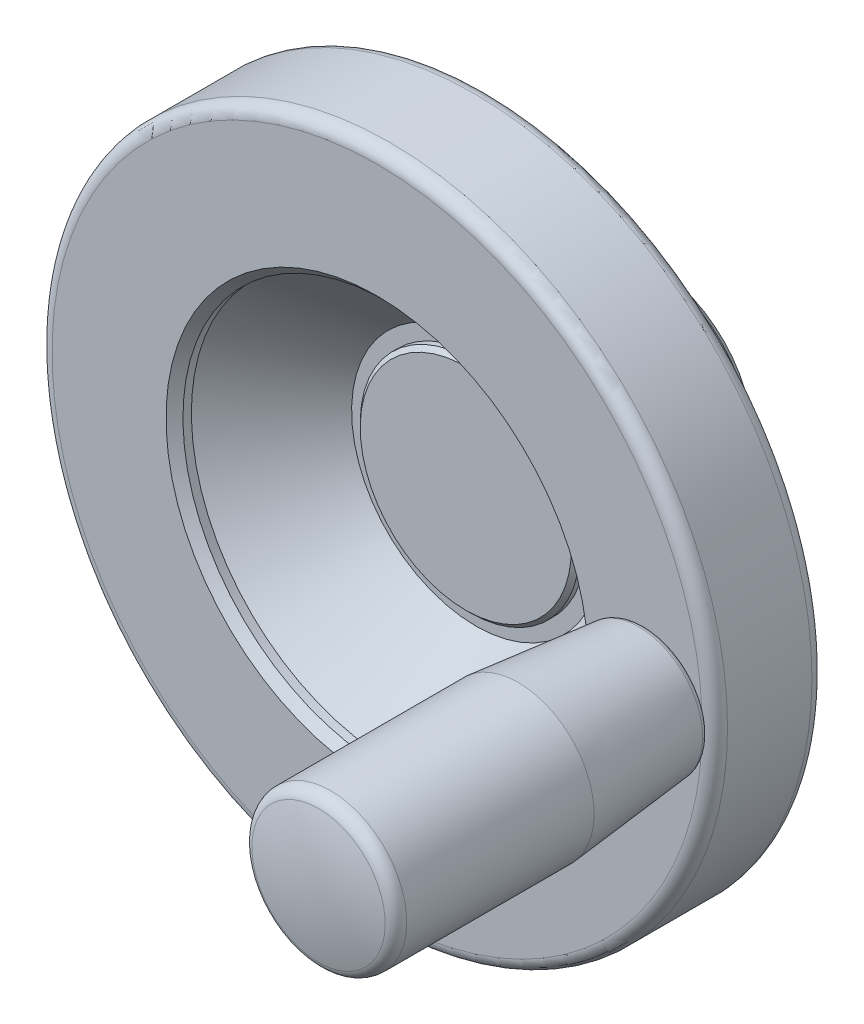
ISO-10303-21;
HEADER;
FILE_DESCRIPTION(('STEP AP214'),'2;1');
FILE_NAME('part.step','',(''),(''),'','','');
FILE_SCHEMA(('AUTOMOTIVE_DESIGN { 1 0 10303 214 1 1 1 1 }'));
ENDSEC;
DATA;
#1=APPLICATION_CONTEXT('core data for automotive mechanical design processes');
#2=APPLICATION_PROTOCOL_DEFINITION('international standard','automotive_design',2000,#1);
#3=PRODUCT_CONTEXT('',#1,'mechanical');
#4=PRODUCT('Part','Part','',(#3));
#5=PRODUCT_RELATED_PRODUCT_CATEGORY('part','',(#4));
#6=PRODUCT_DEFINITION_FORMATION('','',#4);
#7=PRODUCT_DEFINITION_CONTEXT('part definition',#1,'design');
#8=PRODUCT_DEFINITION('design','',#6,#7);
#9=PRODUCT_DEFINITION_SHAPE('','',#8);
#10=(LENGTH_UNIT() NAMED_UNIT(*) SI_UNIT(.MILLI.,.METRE.));
#11=(NAMED_UNIT(*) PLANE_ANGLE_UNIT() SI_UNIT($,.RADIAN.));
#12=(NAMED_UNIT(*) SI_UNIT($,.STERADIAN.) SOLID_ANGLE_UNIT());
#13=UNCERTAINTY_MEASURE_WITH_UNIT(LENGTH_MEASURE(1.E-05),#10,'distance_accuracy_value','');
#14=(GEOMETRIC_REPRESENTATION_CONTEXT(3) GLOBAL_UNCERTAINTY_ASSIGNED_CONTEXT((#13)) GLOBAL_UNIT_ASSIGNED_CONTEXT((#10,
#11,#12)) REPRESENTATION_CONTEXT('',''));
#15=CARTESIAN_POINT('',(0.,0.,0.));
#16=DIRECTION('',(0.,0.,1.));
#17=DIRECTION('',(1.,0.,0.));
#18=AXIS2_PLACEMENT_3D('',#15,#16,#17);
#19=CARTESIAN_POINT('',(38.5,0.,32.5));
#20=DIRECTION('',(0.,0.,-1.));
#21=DIRECTION('',(0.,1.,0.));
#22=AXIS2_PLACEMENT_3D('',#19,#20,#21);
#23=PLANE('',#22);
#24=CARTESIAN_POINT('',(0.,0.,32.5));
#25=DIRECTION('',(0.,0.,1.));
#26=DIRECTION('',(0.,-1.,0.));
#27=AXIS2_PLACEMENT_3D('',#24,#25,#26);
#28=CIRCLE('',#27,38.5);
#29=CARTESIAN_POINT('',(0.,-38.5,32.5));
#30=VERTEX_POINT('',#29);
#31=EDGE_CURVE('E73',#30,#30,#28,.T.);
#32=ORIENTED_EDGE('',*,*,#31,.T.);
#33=EDGE_LOOP('',(#32));
#34=FACE_BOUND('',#33,.T.);
#35=CARTESIAN_POINT('',(0.,0.,32.5));
#36=DIRECTION('',(0.,0.,1.));
#37=DIRECTION('',(0.,-1.,0.));
#38=AXIS2_PLACEMENT_3D('',#35,#36,#37);
#39=CIRCLE('',#38,25.);
#40=CARTESIAN_POINT('',(0.,-25.,32.5));
#41=VERTEX_POINT('',#40);
#42=EDGE_CURVE('E76',#41,#41,#39,.T.);
#43=ORIENTED_EDGE('',*,*,#42,.F.);
#44=EDGE_LOOP('',(#43));
#45=FACE_BOUND('',#44,.T.);
#46=CARTESIAN_POINT('',(32.,0.,32.5));
#47=DIRECTION('',(0.,0.,-1.));
#48=DIRECTION('',(0.,1.,0.));
#49=AXIS2_PLACEMENT_3D('',#46,#47,#48);
#50=CIRCLE('',#49,5.);
#51=CARTESIAN_POINT('',(32.,5.,32.5));
#52=VERTEX_POINT('',#51);
#53=EDGE_CURVE('E9',#52,#52,#50,.F.);
#54=ORIENTED_EDGE('',*,*,#53,.F.);
#55=EDGE_LOOP('',(#54));
#56=FACE_BOUND('',#55,.T.);
#57=ADVANCED_FACE('F14',(#34,#45,#56),#23,.F.);
#58=CARTESIAN_POINT('',(0.,0.,22.));
#59=DIRECTION('',(0.,0.,-1.));
#60=DIRECTION('',(0.,1.,0.));
#61=AXIS2_PLACEMENT_3D('',#58,#59,#60);
#62=CONICAL_SURFACE('',#61,12.5,0.785398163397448);
#63=CARTESIAN_POINT('',(0.,0.,21.5));
#64=DIRECTION('',(0.,0.,1.));
#65=DIRECTION('',(0.,-1.,0.));
#66=AXIS2_PLACEMENT_3D('',#63,#64,#65);
#67=CIRCLE('',#66,13.);
#68=CARTESIAN_POINT('',(0.,-13.,21.5));
#69=VERTEX_POINT('',#68);
#70=EDGE_CURVE('E91',#69,#69,#67,.T.);
#71=ORIENTED_EDGE('',*,*,#70,.T.);
#72=EDGE_LOOP('',(#71));
#73=FACE_BOUND('',#72,.T.);
#74=CARTESIAN_POINT('',(0.,0.,22.));
#75=DIRECTION('',(0.,0.,1.));
#76=DIRECTION('',(0.,-1.,0.));
#77=AXIS2_PLACEMENT_3D('',#74,#75,#76);
#78=CIRCLE('',#77,12.5);
#79=CARTESIAN_POINT('',(0.,-12.5,22.));
#80=VERTEX_POINT('',#79);
#81=EDGE_CURVE('E21',#80,#80,#78,.T.);
#82=ORIENTED_EDGE('',*,*,#81,.F.);
#83=EDGE_LOOP('',(#82));
#84=FACE_BOUND('',#83,.T.);
#85=ADVANCED_FACE('F16',(#73,#84),#62,.T.);
#86=CARTESIAN_POINT('',(0.,0.,22.));
#87=DIRECTION('',(0.,0.,1.));
#88=DIRECTION('',(0.,-1.,0.));
#89=AXIS2_PLACEMENT_3D('',#86,#87,#88);
#90=PLANE('',#89);
#91=ORIENTED_EDGE('',*,*,#81,.T.);
#92=EDGE_LOOP('',(#91));
#93=FACE_BOUND('',#92,.T.);
#94=ADVANCED_FACE('F28',(#93),#90,.T.);
#95=CARTESIAN_POINT('',(0.,0.,9.));
#96=DIRECTION('',(0.,0.,-1.));
#97=DIRECTION('',(0.,1.,0.));
#98=AXIS2_PLACEMENT_3D('',#95,#96,#97);
#99=CONICAL_SURFACE('',#98,2.99999999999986,1.04719755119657);
#100=CARTESIAN_POINT('',(0.,0.,10.732050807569));
#101=VERTEX_POINT('',#100);
#102=VERTEX_LOOP('',#101);
#103=FACE_BOUND('',#102,.T.);
#104=CARTESIAN_POINT('',(0.,0.,9.));
#105=DIRECTION('',(0.,0.,1.));
#106=DIRECTION('',(0.,-1.,0.));
#107=AXIS2_PLACEMENT_3D('',#104,#105,#106);
#108=CIRCLE('',#107,2.99999999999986);
#109=CARTESIAN_POINT('',(0.,-2.99999999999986,9.));
#110=VERTEX_POINT('',#109);
#111=EDGE_CURVE('E32',#110,#110,#108,.T.);
#112=ORIENTED_EDGE('',*,*,#111,.F.);
#113=EDGE_LOOP('',(#112));
#114=FACE_BOUND('',#113,.T.);
#115=ADVANCED_FACE('F24',(#103,#114),#99,.F.);
#116=CARTESIAN_POINT('',(0.,0.,31.5));
#117=DIRECTION('',(0.,0.,1.));
#118=DIRECTION('',(0.,-1.,0.));
#119=AXIS2_PLACEMENT_3D('',#116,#117,#118);
#120=CYLINDRICAL_SURFACE('',#119,2.99999999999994);
#121=ORIENTED_EDGE('',*,*,#111,.T.);
#122=EDGE_LOOP('',(#121));
#123=FACE_BOUND('',#122,.T.);
#124=CARTESIAN_POINT('',(0.,0.,0.));
#125=DIRECTION('',(0.,0.,1.));
#126=DIRECTION('',(0.,-1.,0.));
#127=AXIS2_PLACEMENT_3D('',#124,#125,#126);
#128=CIRCLE('',#127,3.);
#129=CARTESIAN_POINT('',(0.,-3.,0.));
#130=VERTEX_POINT('',#129);
#131=EDGE_CURVE('E34',#130,#130,#128,.T.);
#132=ORIENTED_EDGE('',*,*,#131,.F.);
#133=EDGE_LOOP('',(#132));
#134=FACE_BOUND('',#133,.T.);
#135=ADVANCED_FACE('F27',(#123,#134),#120,.F.);
#136=CARTESIAN_POINT('',(3.,0.,0.));
#137=DIRECTION('',(0.,0.,1.));
#138=DIRECTION('',(0.,-1.,0.));
#139=AXIS2_PLACEMENT_3D('',#136,#137,#138);
#140=PLANE('',#139);
#141=CARTESIAN_POINT('',(0.,0.,0.));
#142=DIRECTION('',(0.,0.,1.));
#143=DIRECTION('',(0.,-1.,0.));
#144=AXIS2_PLACEMENT_3D('',#141,#142,#143);
#145=CIRCLE('',#144,12.);
#146=CARTESIAN_POINT('',(0.,-12.,0.));
#147=VERTEX_POINT('',#146);
#148=EDGE_CURVE('E38',#147,#147,#145,.T.);
#149=ORIENTED_EDGE('',*,*,#148,.F.);
#150=EDGE_LOOP('',(#149));
#151=FACE_BOUND('',#150,.T.);
#152=ORIENTED_EDGE('',*,*,#131,.T.);
#153=EDGE_LOOP('',(#152));
#154=FACE_BOUND('',#153,.T.);
#155=ADVANCED_FACE('F182',(#151,#154),#140,.F.);
#156=CARTESIAN_POINT('',(0.,0.,0.));
#157=DIRECTION('',(0.,0.,1.));
#158=DIRECTION('',(0.,-1.,0.));
#159=AXIS2_PLACEMENT_3D('',#156,#157,#158);
#160=CONICAL_SURFACE('',#159,12.,0.785398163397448);
#161=CARTESIAN_POINT('',(0.,0.,1.));
#162=DIRECTION('',(0.,0.,1.));
#163=DIRECTION('',(0.,-1.,0.));
#164=AXIS2_PLACEMENT_3D('',#161,#162,#163);
#165=CIRCLE('',#164,13.);
#166=CARTESIAN_POINT('',(0.,-13.,1.));
#167=VERTEX_POINT('',#166);
#168=EDGE_CURVE('E43',#167,#167,#165,.T.);
#169=ORIENTED_EDGE('',*,*,#168,.F.);
#170=EDGE_LOOP('',(#169));
#171=FACE_BOUND('',#170,.T.);
#172=ORIENTED_EDGE('',*,*,#148,.T.);
#173=EDGE_LOOP('',(#172));
#174=FACE_BOUND('',#173,.T.);
#175=ADVANCED_FACE('F178',(#171,#174),#160,.T.);
#176=CARTESIAN_POINT('',(0.,0.,31.5));
#177=DIRECTION('',(0.,0.,1.));
#178=DIRECTION('',(0.,-1.,0.));
#179=AXIS2_PLACEMENT_3D('',#176,#177,#178);
#180=CYLINDRICAL_SURFACE('',#179,13.);
#181=ORIENTED_EDGE('',*,*,#168,.T.);
#182=EDGE_LOOP('',(#181));
#183=FACE_BOUND('',#182,.T.);
#184=CARTESIAN_POINT('',(0.,0.,11.6));
#185=DIRECTION('',(0.,0.,1.));
#186=DIRECTION('',(0.,-1.,0.));
#187=AXIS2_PLACEMENT_3D('',#184,#185,#186);
#188=CIRCLE('',#187,13.);
#189=CARTESIAN_POINT('',(0.,-13.,11.6));
#190=VERTEX_POINT('',#189);
#191=EDGE_CURVE('E46',#190,#190,#188,.T.);
#192=ORIENTED_EDGE('',*,*,#191,.F.);
#193=EDGE_LOOP('',(#192));
#194=FACE_BOUND('',#193,.T.);
#195=ADVANCED_FACE('F174',(#183,#194),#180,.T.);
#196=CARTESIAN_POINT('',(0.,0.,11.6));
#197=DIRECTION('',(0.,0.,1.));
#198=DIRECTION('',(0.,-1.,0.));
#199=AXIS2_PLACEMENT_3D('',#196,#197,#198);
#200=TOROIDAL_SURFACE('',#199,13.4,0.399999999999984);
#201=ORIENTED_EDGE('',*,*,#191,.T.);
#202=EDGE_LOOP('',(#201));
#203=FACE_BOUND('',#202,.T.);
#204=CARTESIAN_POINT('',(0.,0.,12.));
#205=DIRECTION('',(0.,0.,1.));
#206=DIRECTION('',(0.,-1.,0.));
#207=AXIS2_PLACEMENT_3D('',#204,#205,#206);
#208=CIRCLE('',#207,13.4);
#209=CARTESIAN_POINT('',(0.,-13.4,12.));
#210=VERTEX_POINT('',#209);
#211=EDGE_CURVE('E49',#210,#210,#208,.T.);
#212=ORIENTED_EDGE('',*,*,#211,.F.);
#213=EDGE_LOOP('',(#212));
#214=FACE_BOUND('',#213,.T.);
#215=ADVANCED_FACE('F170',(#203,#214),#200,.F.);
#216=CARTESIAN_POINT('',(15.,0.,12.));
#217=DIRECTION('',(0.,0.,-1.));
#218=DIRECTION('',(0.,1.,0.));
#219=AXIS2_PLACEMENT_3D('',#216,#217,#218);
#220=PLANE('',#219);
#221=ORIENTED_EDGE('',*,*,#211,.T.);
#222=EDGE_LOOP('',(#221));
#223=FACE_BOUND('',#222,.T.);
#224=CARTESIAN_POINT('',(0.,0.,12.));
#225=DIRECTION('',(0.,0.,1.));
#226=DIRECTION('',(0.,-1.,0.));
#227=AXIS2_PLACEMENT_3D('',#224,#225,#226);
#228=CIRCLE('',#227,15.);
#229=CARTESIAN_POINT('',(0.,-15.,12.));
#230=VERTEX_POINT('',#229);
#231=EDGE_CURVE('E52',#230,#230,#228,.T.);
#232=ORIENTED_EDGE('',*,*,#231,.F.);
#233=EDGE_LOOP('',(#232));
#234=FACE_BOUND('',#233,.T.);
#235=ADVANCED_FACE('F166',(#223,#234),#220,.T.);
#236=CARTESIAN_POINT('',(0.,0.,31.5));
#237=DIRECTION('',(0.,0.,1.));
#238=DIRECTION('',(0.,-1.,0.));
#239=AXIS2_PLACEMENT_3D('',#236,#237,#238);
#240=CYLINDRICAL_SURFACE('',#239,15.);
#241=CARTESIAN_POINT('',(0.,0.,12.675420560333));
#242=DIRECTION('',(0.,0.,1.));
#243=DIRECTION('',(0.,-1.,0.));
#244=AXIS2_PLACEMENT_3D('',#241,#242,#243);
#245=CIRCLE('',#244,15.);
#246=CARTESIAN_POINT('',(0.,-15.,12.675420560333));
#247=VERTEX_POINT('',#246);
#248=EDGE_CURVE('E55',#247,#247,#245,.T.);
#249=ORIENTED_EDGE('',*,*,#248,.F.);
#250=EDGE_LOOP('',(#249));
#251=FACE_BOUND('',#250,.T.);
#252=ORIENTED_EDGE('',*,*,#231,.T.);
#253=EDGE_LOOP('',(#252));
#254=FACE_BOUND('',#253,.T.);
#255=ADVANCED_FACE('F162',(#251,#254),#240,.T.);
#256=CARTESIAN_POINT('',(0.,0.,12.675420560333));
#257=DIRECTION('',(0.,0.,1.));
#258=DIRECTION('',(0.,-1.,0.));
#259=AXIS2_PLACEMENT_3D('',#256,#257,#258);
#260=TOROIDAL_SURFACE('',#259,20.,5.);
#261=ORIENTED_EDGE('',*,*,#248,.T.);
#262=EDGE_LOOP('',(#261));
#263=FACE_BOUND('',#262,.T.);
#264=CARTESIAN_POINT('',(0.,0.,15.833785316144));
#265=DIRECTION('',(0.,0.,1.));
#266=DIRECTION('',(0.,-1.,0.));
#267=AXIS2_PLACEMENT_3D('',#264,#265,#266);
#268=CIRCLE('',#267,16.1238250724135);
#269=CARTESIAN_POINT('',(0.,-16.1238250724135,15.833785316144));
#270=VERTEX_POINT('',#269);
#271=EDGE_CURVE('E58',#270,#270,#268,.T.);
#272=ORIENTED_EDGE('',*,*,#271,.F.);
#273=EDGE_LOOP('',(#272));
#274=FACE_BOUND('',#273,.T.);
#275=ADVANCED_FACE('F158',(#263,#274),#260,.F.);
#276=CARTESIAN_POINT('',(0.,0.,15.833785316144));
#277=DIRECTION('',(0.,0.,1.));
#278=DIRECTION('',(0.,-1.,0.));
#279=AXIS2_PLACEMENT_3D('',#276,#277,#278);
#280=CONICAL_SURFACE('',#279,16.1238250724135,0.683709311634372);
#281=CARTESIAN_POINT('',(0.,0.,19.5));
#282=DIRECTION('',(0.,0.,1.));
#283=DIRECTION('',(0.,-1.,0.));
#284=AXIS2_PLACEMENT_3D('',#281,#282,#283);
#285=CIRCLE('',#284,19.1111111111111);
#286=CARTESIAN_POINT('',(0.,-19.1111111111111,19.5));
#287=VERTEX_POINT('',#286);
#288=EDGE_CURVE('E61',#287,#287,#285,.T.);
#289=ORIENTED_EDGE('',*,*,#288,.F.);
#290=EDGE_LOOP('',(#289));
#291=FACE_BOUND('',#290,.T.);
#292=ORIENTED_EDGE('',*,*,#271,.T.);
#293=EDGE_LOOP('',(#292));
#294=FACE_BOUND('',#293,.T.);
#295=ADVANCED_FACE('F154',(#291,#294),#280,.T.);
#296=CARTESIAN_POINT('',(19.1111111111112,0.,19.5));
#297=DIRECTION('',(0.,0.,1.));
#298=DIRECTION('',(0.,-1.,0.));
#299=AXIS2_PLACEMENT_3D('',#296,#297,#298);
#300=PLANE('',#299);
#301=CARTESIAN_POINT('',(0.,0.,19.5));
#302=DIRECTION('',(0.,0.,1.));
#303=DIRECTION('',(0.,-1.,0.));
#304=AXIS2_PLACEMENT_3D('',#301,#302,#303);
#305=CIRCLE('',#304,38.5);
#306=CARTESIAN_POINT('',(0.,-38.5,19.5));
#307=VERTEX_POINT('',#306);
#308=EDGE_CURVE('E64',#307,#307,#305,.T.);
#309=ORIENTED_EDGE('',*,*,#308,.F.);
#310=EDGE_LOOP('',(#309));
#311=FACE_BOUND('',#310,.T.);
#312=ORIENTED_EDGE('',*,*,#288,.T.);
#313=EDGE_LOOP('',(#312));
#314=FACE_BOUND('',#313,.T.);
#315=ADVANCED_FACE('F150',(#311,#314),#300,.F.);
#316=CARTESIAN_POINT('',(0.,0.,21.));
#317=DIRECTION('',(0.,0.,1.));
#318=DIRECTION('',(0.,-1.,0.));
#319=AXIS2_PLACEMENT_3D('',#316,#317,#318);
#320=TOROIDAL_SURFACE('',#319,38.5,1.5);
#321=CARTESIAN_POINT('',(0.,0.,21.));
#322=DIRECTION('',(0.,0.,1.));
#323=DIRECTION('',(0.,-1.,0.));
#324=AXIS2_PLACEMENT_3D('',#321,#322,#323);
#325=CIRCLE('',#324,40.);
#326=CARTESIAN_POINT('',(0.,-40.,21.));
#327=VERTEX_POINT('',#326);
#328=EDGE_CURVE('E67',#327,#327,#325,.T.);
#329=ORIENTED_EDGE('',*,*,#328,.F.);
#330=EDGE_LOOP('',(#329));
#331=FACE_BOUND('',#330,.T.);
#332=ORIENTED_EDGE('',*,*,#308,.T.);
#333=EDGE_LOOP('',(#332));
#334=FACE_BOUND('',#333,.T.);
#335=ADVANCED_FACE('F146',(#331,#334),#320,.T.);
#336=CARTESIAN_POINT('',(0.,0.,31.5));
#337=DIRECTION('',(0.,0.,1.));
#338=DIRECTION('',(0.,-1.,0.));
#339=AXIS2_PLACEMENT_3D('',#336,#337,#338);
#340=CYLINDRICAL_SURFACE('',#339,40.);
#341=CARTESIAN_POINT('',(0.,0.,31.));
#342=DIRECTION('',(0.,0.,1.));
#343=DIRECTION('',(0.,-1.,0.));
#344=AXIS2_PLACEMENT_3D('',#341,#342,#343);
#345=CIRCLE('',#344,40.);
#346=CARTESIAN_POINT('',(0.,-40.,31.));
#347=VERTEX_POINT('',#346);
#348=EDGE_CURVE('E70',#347,#347,#345,.T.);
#349=ORIENTED_EDGE('',*,*,#348,.F.);
#350=EDGE_LOOP('',(#349));
#351=FACE_BOUND('',#350,.T.);
#352=ORIENTED_EDGE('',*,*,#328,.T.);
#353=EDGE_LOOP('',(#352));
#354=FACE_BOUND('',#353,.T.);
#355=ADVANCED_FACE('F142',(#351,#354),#340,.T.);
#356=CARTESIAN_POINT('',(0.,0.,31.));
#357=DIRECTION('',(0.,0.,1.));
#358=DIRECTION('',(0.,-1.,0.));
#359=AXIS2_PLACEMENT_3D('',#356,#357,#358);
#360=TOROIDAL_SURFACE('',#359,38.5,1.5);
#361=ORIENTED_EDGE('',*,*,#31,.F.);
#362=EDGE_LOOP('',(#361));
#363=FACE_BOUND('',#362,.T.);
#364=ORIENTED_EDGE('',*,*,#348,.T.);
#365=EDGE_LOOP('',(#364));
#366=FACE_BOUND('',#365,.T.);
#367=ADVANCED_FACE('F139',(#363,#366),#360,.T.);
#368=CARTESIAN_POINT('',(0.,0.,32.5));
#369=DIRECTION('',(0.,0.,1.));
#370=DIRECTION('',(0.,-1.,0.));
#371=AXIS2_PLACEMENT_3D('',#368,#369,#370);
#372=CONICAL_SURFACE('',#371,25.,0.785398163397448);
#373=CARTESIAN_POINT('',(0.,0.,31.5));
#374=DIRECTION('',(0.,0.,1.));
#375=DIRECTION('',(0.,-1.,0.));
#376=AXIS2_PLACEMENT_3D('',#373,#374,#375);
#377=CIRCLE('',#376,24.);
#378=CARTESIAN_POINT('',(0.,-24.,31.5));
#379=VERTEX_POINT('',#378);
#380=EDGE_CURVE('E79',#379,#379,#377,.T.);
#381=ORIENTED_EDGE('',*,*,#380,.F.);
#382=EDGE_LOOP('',(#381));
#383=FACE_BOUND('',#382,.T.);
#384=ORIENTED_EDGE('',*,*,#42,.T.);
#385=EDGE_LOOP('',(#384));
#386=FACE_BOUND('',#385,.T.);
#387=ADVANCED_FACE('F137',(#383,#386),#372,.F.);
#388=CARTESIAN_POINT('',(0.,0.,31.5));
#389=DIRECTION('',(0.,0.,1.));
#390=DIRECTION('',(0.,-1.,0.));
#391=AXIS2_PLACEMENT_3D('',#388,#389,#390);
#392=CYLINDRICAL_SURFACE('',#391,24.);
#393=CARTESIAN_POINT('',(0.,0.,30.5));
#394=DIRECTION('',(0.,0.,1.));
#395=DIRECTION('',(0.,-1.,0.));
#396=AXIS2_PLACEMENT_3D('',#393,#394,#395);
#397=CIRCLE('',#396,24.);
#398=CARTESIAN_POINT('',(0.,-24.,30.5));
#399=VERTEX_POINT('',#398);
#400=EDGE_CURVE('E82',#399,#399,#397,.T.);
#401=ORIENTED_EDGE('',*,*,#400,.F.);
#402=EDGE_LOOP('',(#401));
#403=FACE_BOUND('',#402,.T.);
#404=ORIENTED_EDGE('',*,*,#380,.T.);
#405=EDGE_LOOP('',(#404));
#406=FACE_BOUND('',#405,.T.);
#407=ADVANCED_FACE('F278',(#403,#406),#392,.F.);
#408=CARTESIAN_POINT('',(0.,0.,30.5));
#409=DIRECTION('',(0.,0.,1.));
#410=DIRECTION('',(0.,-1.,0.));
#411=AXIS2_PLACEMENT_3D('',#408,#409,#410);
#412=CONICAL_SURFACE('',#411,24.,0.763179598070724);
#413=CARTESIAN_POINT('',(0.,0.,20.8009437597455));
#414=DIRECTION('',(0.,0.,1.));
#415=DIRECTION('',(0.,-1.,0.));
#416=AXIS2_PLACEMENT_3D('',#413,#414,#415);
#417=CIRCLE('',#416,14.7226418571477);
#418=CARTESIAN_POINT('',(0.,-14.7226418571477,20.8009437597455));
#419=VERTEX_POINT('',#418);
#420=EDGE_CURVE('E85',#419,#419,#417,.T.);
#421=ORIENTED_EDGE('',*,*,#420,.F.);
#422=EDGE_LOOP('',(#421));
#423=FACE_BOUND('',#422,.T.);
#424=ORIENTED_EDGE('',*,*,#400,.T.);
#425=EDGE_LOOP('',(#424));
#426=FACE_BOUND('',#425,.T.);
#427=ADVANCED_FACE('F286',(#423,#426),#412,.F.);
#428=CARTESIAN_POINT('',(14.7226418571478,0.,20.8009437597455));
#429=DIRECTION('',(0.,0.,-1.));
#430=DIRECTION('',(0.,1.,0.));
#431=AXIS2_PLACEMENT_3D('',#428,#429,#430);
#432=PLANE('',#431);
#433=CARTESIAN_POINT('',(0.,0.,20.8009437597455));
#434=DIRECTION('',(0.,0.,1.));
#435=DIRECTION('',(0.,-1.,0.));
#436=AXIS2_PLACEMENT_3D('',#433,#434,#435);
#437=CIRCLE('',#436,13.);
#438=CARTESIAN_POINT('',(0.,-13.,20.8009437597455));
#439=VERTEX_POINT('',#438);
#440=EDGE_CURVE('E88',#439,#439,#437,.T.);
#441=ORIENTED_EDGE('',*,*,#440,.F.);
#442=EDGE_LOOP('',(#441));
#443=FACE_BOUND('',#442,.T.);
#444=ORIENTED_EDGE('',*,*,#420,.T.);
#445=EDGE_LOOP('',(#444));
#446=FACE_BOUND('',#445,.T.);
#447=ADVANCED_FACE('F294',(#443,#446),#432,.F.);
#448=CARTESIAN_POINT('',(0.,0.,31.5));
#449=DIRECTION('',(0.,0.,1.));
#450=DIRECTION('',(0.,-1.,0.));
#451=AXIS2_PLACEMENT_3D('',#448,#449,#450);
#452=CYLINDRICAL_SURFACE('',#451,13.);
#453=ORIENTED_EDGE('',*,*,#440,.T.);
#454=EDGE_LOOP('',(#453));
#455=FACE_BOUND('',#454,.T.);
#456=ORIENTED_EDGE('',*,*,#70,.F.);
#457=EDGE_LOOP('',(#456));
#458=FACE_BOUND('',#457,.T.);
#459=ADVANCED_FACE('F303',(#455,#458),#452,.T.);
#460=CARTESIAN_POINT('',(32.,0.,9.47604815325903));
#461=DIRECTION('',(0.,0.,-1.));
#462=DIRECTION('',(0.,1.,0.));
#463=AXIS2_PLACEMENT_3D('',#460,#461,#462);
#464=CYLINDRICAL_SURFACE('',#463,5.);
#465=ORIENTED_EDGE('',*,*,#53,.T.);
#466=EDGE_LOOP('',(#465));
#467=FACE_BOUND('',#466,.T.);
#468=CARTESIAN_POINT('',(32.,0.,32.8000000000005));
#469=DIRECTION('',(0.,0.,-1.));
#470=DIRECTION('',(0.,1.,0.));
#471=AXIS2_PLACEMENT_3D('',#468,#469,#470);
#472=CIRCLE('',#471,5.);
#473=CARTESIAN_POINT('',(32.,5.,32.8000000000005));
#474=VERTEX_POINT('',#473);
#475=EDGE_CURVE('E94',#474,#474,#472,.T.);
#476=ORIENTED_EDGE('',*,*,#475,.T.);
#477=EDGE_LOOP('',(#476));
#478=FACE_BOUND('',#477,.T.);
#479=ADVANCED_FACE('F312',(#467,#478),#464,.T.);
#480=CARTESIAN_POINT('',(38.77600995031,0.,32.8000000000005));
#481=DIRECTION('',(0.,0.,1.));
#482=DIRECTION('',(0.,-1.,0.));
#483=AXIS2_PLACEMENT_3D('',#480,#481,#482);
#484=PLANE('',#483);
#485=ORIENTED_EDGE('',*,*,#475,.F.);
#486=EDGE_LOOP('',(#485));
#487=FACE_BOUND('',#486,.T.);
#488=CARTESIAN_POINT('',(32.,0.,32.8000000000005));
#489=DIRECTION('',(0.,0.,-1.));
#490=DIRECTION('',(0.,1.,0.));
#491=AXIS2_PLACEMENT_3D('',#488,#489,#490);
#492=CIRCLE('',#491,6.77600995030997);
#493=CARTESIAN_POINT('',(32.,6.77600995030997,32.8000000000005));
#494=VERTEX_POINT('',#493);
#495=EDGE_CURVE('E97',#494,#494,#492,.T.);
#496=ORIENTED_EDGE('',*,*,#495,.T.);
#497=EDGE_LOOP('',(#496));
#498=FACE_BOUND('',#497,.T.);
#499=ADVANCED_FACE('F321',(#487,#498),#484,.F.);
#500=CARTESIAN_POINT('',(32.,0.,33.6000000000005));
#501=DIRECTION('',(0.,0.,-1.));
#502=DIRECTION('',(0.,1.,0.));
#503=AXIS2_PLACEMENT_3D('',#500,#501,#502);
#504=TOROIDAL_SURFACE('',#503,6.77600995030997,0.800000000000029);
#505=CARTESIAN_POINT('',(32.,0.,33.5203970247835));
#506=DIRECTION('',(0.,0.,-1.));
#507=DIRECTION('',(0.,1.,0.));
#508=AXIS2_PLACEMENT_3D('',#505,#506,#507);
#509=CIRCLE('',#508,7.572039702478);
#510=CARTESIAN_POINT('',(32.,7.572039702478,33.5203970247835));
#511=VERTEX_POINT('',#510);
#512=EDGE_CURVE('E100',#511,#511,#509,.T.);
#513=ORIENTED_EDGE('',*,*,#512,.T.);
#514=EDGE_LOOP('',(#513));
#515=FACE_BOUND('',#514,.T.);
#516=ORIENTED_EDGE('',*,*,#495,.F.);
#517=EDGE_LOOP('',(#516));
#518=FACE_BOUND('',#517,.T.);
#519=ADVANCED_FACE('F330',(#515,#518),#504,.T.);
#520=CARTESIAN_POINT('',(32.,0.,47.8));
#521=DIRECTION('',(0.,0.,1.));
#522=DIRECTION('',(0.,-1.,0.));
#523=AXIS2_PLACEMENT_3D('',#520,#521,#522);
#524=CONICAL_SURFACE('',#523,9.,0.0996686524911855);
#525=ORIENTED_EDGE('',*,*,#512,.F.);
#526=EDGE_LOOP('',(#525));
#527=FACE_BOUND('',#526,.T.);
#528=CARTESIAN_POINT('',(32.,0.,47.8));
#529=DIRECTION('',(0.,0.,-1.));
#530=DIRECTION('',(0.,1.,0.));
#531=AXIS2_PLACEMENT_3D('',#528,#529,#530);
#532=CIRCLE('',#531,9.);
#533=CARTESIAN_POINT('',(32.,9.,47.8));
#534=VERTEX_POINT('',#533);
#535=EDGE_CURVE('E103',#534,#534,#532,.T.);
#536=ORIENTED_EDGE('',*,*,#535,.T.);
#537=EDGE_LOOP('',(#536));
#538=FACE_BOUND('',#537,.T.);
#539=ADVANCED_FACE('F339',(#527,#538),#524,.T.);
#540=CARTESIAN_POINT('',(32.,0.,9.47604815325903));
#541=DIRECTION('',(0.,0.,-1.));
#542=DIRECTION('',(0.,1.,0.));
#543=AXIS2_PLACEMENT_3D('',#540,#541,#542);
#544=CYLINDRICAL_SURFACE('',#543,9.);
#545=ORIENTED_EDGE('',*,*,#535,.F.);
#546=EDGE_LOOP('',(#545));
#547=FACE_BOUND('',#546,.T.);
#548=CARTESIAN_POINT('',(32.,0.,69.9954541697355));
#549=DIRECTION('',(0.,0.,-1.));
#550=DIRECTION('',(0.,1.,0.));
#551=AXIS2_PLACEMENT_3D('',#548,#549,#550);
#552=CIRCLE('',#551,9.);
#553=CARTESIAN_POINT('',(32.,9.,69.9954541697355));
#554=VERTEX_POINT('',#553);
#555=EDGE_CURVE('E106',#554,#554,#552,.T.);
#556=ORIENTED_EDGE('',*,*,#555,.T.);
#557=EDGE_LOOP('',(#556));
#558=FACE_BOUND('',#557,.T.);
#559=ADVANCED_FACE('F124',(#547,#558),#544,.T.);
#560=CARTESIAN_POINT('',(32.,0.,69.9954541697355));
#561=DIRECTION('',(0.,0.,-1.));
#562=DIRECTION('',(0.,1.,0.));
#563=AXIS2_PLACEMENT_3D('',#560,#561,#562);
#564=TOROIDAL_SURFACE('',#563,7.50000000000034,1.49999999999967);
#565=CARTESIAN_POINT('',(32.,0.,71.4425833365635));
#566=DIRECTION('',(0.,0.,-1.));
#567=DIRECTION('',(0.,1.,0.));
#568=AXIS2_PLACEMENT_3D('',#565,#566,#567);
#569=CIRCLE('',#568,7.89473684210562);
#570=CARTESIAN_POINT('',(32.,7.89473684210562,71.4425833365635));
#571=VERTEX_POINT('',#570);
#572=EDGE_CURVE('E109',#571,#571,#569,.T.);
#573=ORIENTED_EDGE('',*,*,#572,.T.);
#574=EDGE_LOOP('',(#573));
#575=FACE_BOUND('',#574,.T.);
#576=ORIENTED_EDGE('',*,*,#555,.F.);
#577=EDGE_LOOP('',(#576));
#578=FACE_BOUND('',#577,.T.);
#579=ADVANCED_FACE('F113',(#575,#578),#564,.T.);
#580=CARTESIAN_POINT('',(32.0000000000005,0.,42.5));
#581=DIRECTION('',(0.,-1.,0.));
#582=DIRECTION('',(0.,0.,-1.));
#583=AXIS2_PLACEMENT_3D('',#580,#581,#582);
#584=SPHERICAL_SURFACE('',#583,30.);
#585=CARTESIAN_POINT('',(32.0000000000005,0.,42.5));
#586=DIRECTION('',(0.,0.,-1.));
#587=DIRECTION('',(0.,1.,0.));
#588=AXIS2_PLACEMENT_3D('',#585,#586,#587);
#589=SPHERICAL_SURFACE('',#588,30.);
#590=ORIENTED_EDGE('',*,*,#572,.F.);
#591=EDGE_LOOP('',(#590));
#592=FACE_BOUND('',#591,.T.);
#593=ADVANCED_FACE('F116',(#592),#589,.T.);
#594=CLOSED_SHELL('',(#57,#85,#94,#115,#135,#155,#175,#195,#215,#235,#255,#275,#295,#315,#335,
#355,#367,#387,#407,#427,#447,#459,#479,#499,#519,#539,#559,#579,#593));
#595=MANIFOLD_SOLID_BREP('B1',#594);
#596=ADVANCED_BREP_SHAPE_REPRESENTATION('',(#18,#595),#14);
#597=SHAPE_DEFINITION_REPRESENTATION(#9,#596);
ENDSEC;
END-ISO-10303-21;
